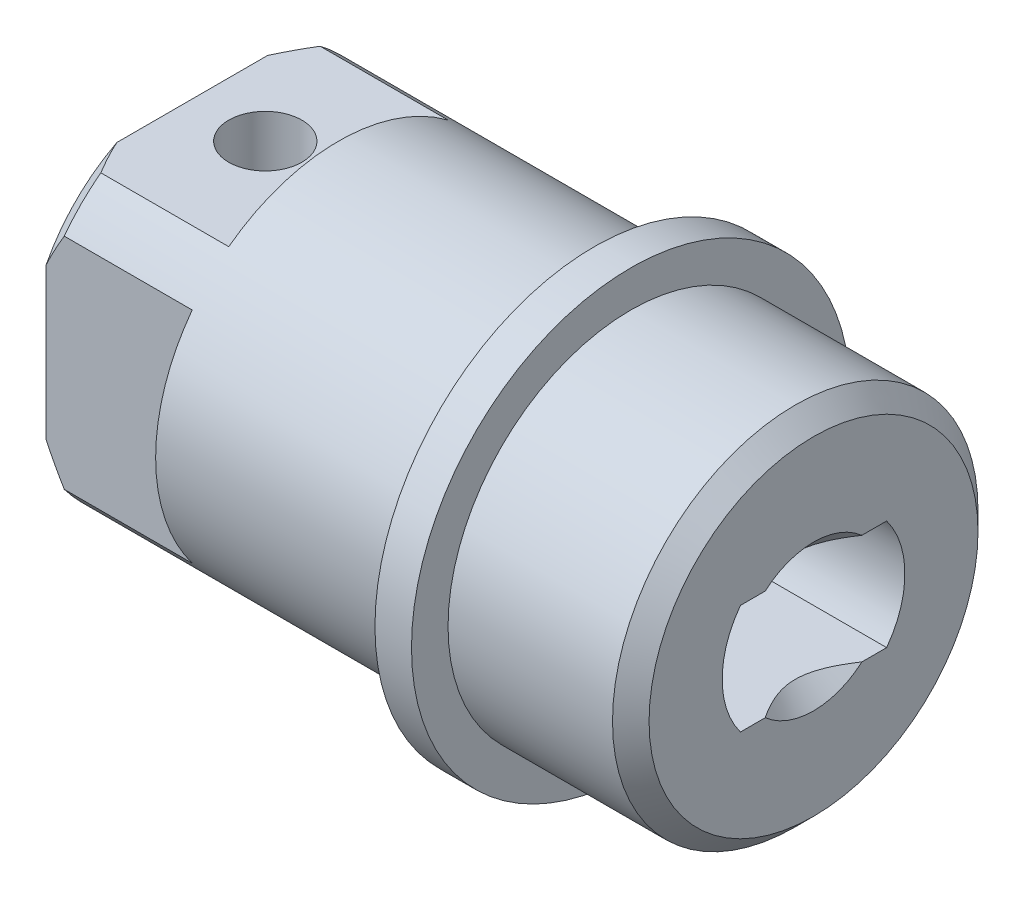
ISO-10303-21;
HEADER;
FILE_DESCRIPTION(('STEP AP214'),'2;1');
FILE_NAME('part.step','',(''),(''),'','','');
FILE_SCHEMA(('AUTOMOTIVE_DESIGN { 1 0 10303 214 1 1 1 1 }'));
ENDSEC;
DATA;
#1=APPLICATION_CONTEXT('core data for automotive mechanical design processes');
#2=APPLICATION_PROTOCOL_DEFINITION('international standard','automotive_design',2000,#1);
#3=PRODUCT_CONTEXT('',#1,'mechanical');
#4=PRODUCT('Part','Part','',(#3));
#5=PRODUCT_RELATED_PRODUCT_CATEGORY('part','',(#4));
#6=PRODUCT_DEFINITION_FORMATION('','',#4);
#7=PRODUCT_DEFINITION_CONTEXT('part definition',#1,'design');
#8=PRODUCT_DEFINITION('design','',#6,#7);
#9=PRODUCT_DEFINITION_SHAPE('','',#8);
#10=(LENGTH_UNIT() NAMED_UNIT(*) SI_UNIT(.MILLI.,.METRE.));
#11=(NAMED_UNIT(*) PLANE_ANGLE_UNIT() SI_UNIT($,.RADIAN.));
#12=(NAMED_UNIT(*) SI_UNIT($,.STERADIAN.) SOLID_ANGLE_UNIT());
#13=UNCERTAINTY_MEASURE_WITH_UNIT(LENGTH_MEASURE(1.E-05),#10,'distance_accuracy_value','');
#14=(GEOMETRIC_REPRESENTATION_CONTEXT(3) GLOBAL_UNCERTAINTY_ASSIGNED_CONTEXT((#13)) GLOBAL_UNIT_ASSIGNED_CONTEXT((#10,
#11,#12)) REPRESENTATION_CONTEXT('',''));
#15=CARTESIAN_POINT('',(0.,0.,0.));
#16=DIRECTION('',(0.,0.,1.));
#17=DIRECTION('',(1.,0.,0.));
#18=AXIS2_PLACEMENT_3D('',#15,#16,#17);
#19=CARTESIAN_POINT('',(17.,0.,0.));
#20=DIRECTION('',(1.,0.,0.));
#21=DIRECTION('',(0.,0.,-1.));
#22=AXIS2_PLACEMENT_3D('',#19,#20,#21);
#23=CONICAL_SURFACE('',#22,2.,0.785398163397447);
#24=CARTESIAN_POINT('',(18.2772597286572,1.5,-2.91383447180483));
#25=CARTESIAN_POINT('',(18.217244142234,1.5,-2.84632281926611));
#26=CARTESIAN_POINT('',(18.1574614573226,1.5,-2.77860211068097));
#27=CARTESIAN_POINT('',(18.0384866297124,1.5,-2.64263139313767));
#28=CARTESIAN_POINT('',(17.9792945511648,1.5,-2.57438132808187));
#29=CARTESIAN_POINT('',(17.8613803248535,1.5,-2.43695412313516));
#30=CARTESIAN_POINT('',(17.8026613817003,1.5,-2.36777422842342));
#31=CARTESIAN_POINT('',(17.6861500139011,1.5,-2.22864291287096));
#32=CARTESIAN_POINT('',(17.628357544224,1.5,-2.15869152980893));
#33=CARTESIAN_POINT('',(17.5105935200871,1.5,-2.01369677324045));
#34=CARTESIAN_POINT('',(17.4506930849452,1.5,-1.93859546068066));
#35=CARTESIAN_POINT('',(17.3326420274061,1.5,-1.78703130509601));
#36=CARTESIAN_POINT('',(17.2744912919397,1.5,-1.71056855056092));
#37=CARTESIAN_POINT('',(17.160664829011,1.5,-1.55602138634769));
#38=CARTESIAN_POINT('',(17.1049849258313,1.5,-1.47794006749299));
#39=CARTESIAN_POINT('',(16.9969436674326,1.5,-1.31952631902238));
#40=CARTESIAN_POINT('',(16.9445811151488,1.5,-1.2391947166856));
#41=CARTESIAN_POINT('',(16.8598759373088,1.5,-1.10052560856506));
#42=CARTESIAN_POINT('',(16.826296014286,1.5,-1.0429476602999));
#43=CARTESIAN_POINT('',(16.7621699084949,1.5,-0.926084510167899));
#44=CARTESIAN_POINT('',(16.7316246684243,1.5,-0.8667987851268));
#45=CARTESIAN_POINT('',(16.6747957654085,1.5,-0.746799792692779));
#46=CARTESIAN_POINT('',(16.6484787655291,1.5,-0.686102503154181));
#47=CARTESIAN_POINT('',(16.6010598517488,1.5,-0.562697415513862));
#48=CARTESIAN_POINT('',(16.5799546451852,1.5,-0.499990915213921));
#49=CARTESIAN_POINT('',(16.5499980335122,1.5,-0.392743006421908));
#50=CARTESIAN_POINT('',(16.539380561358,1.5,-0.348695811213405));
#51=CARTESIAN_POINT('',(16.5217274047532,1.5,-0.259894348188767));
#52=CARTESIAN_POINT('',(16.5146903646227,1.5,-0.215140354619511));
#53=CARTESIAN_POINT('',(16.5045647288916,1.5,-0.125302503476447));
#54=CARTESIAN_POINT('',(16.5014656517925,1.5,-0.0802198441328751));
#55=CARTESIAN_POINT('',(16.4993550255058,1.5,0.0100433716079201));
#56=CARTESIAN_POINT('',(16.5003435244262,1.5,0.0552239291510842));
#57=CARTESIAN_POINT('',(16.5063457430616,1.5,0.14522645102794));
#58=CARTESIAN_POINT('',(16.5113518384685,1.5,0.190048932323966));
#59=CARTESIAN_POINT('',(16.5251125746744,1.5,0.279116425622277));
#60=CARTESIAN_POINT('',(16.5338680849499,1.5,0.32336130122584));
#61=CARTESIAN_POINT('',(16.5547555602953,1.5,0.41121072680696));
#62=CARTESIAN_POINT('',(16.5668999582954,1.5,0.454812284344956));
#63=CARTESIAN_POINT('',(16.5940844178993,1.5,0.541090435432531));
#64=CARTESIAN_POINT('',(16.6091244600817,1.5,0.583767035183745));
#65=CARTESIAN_POINT('',(16.6679542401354,1.5,0.73656486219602));
#66=CARTESIAN_POINT('',(16.7188477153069,1.5,0.843947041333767));
#67=CARTESIAN_POINT('',(16.8307538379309,1.5,1.05333291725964));
#68=CARTESIAN_POINT('',(16.8917907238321,1.5,1.15532294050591));
#69=CARTESIAN_POINT('',(17.0210353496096,1.5,1.35668988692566));
#70=CARTESIAN_POINT('',(17.0893335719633,1.5,1.4560081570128));
#71=CARTESIAN_POINT('',(17.1948474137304,1.5,1.60265082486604));
#72=CARTESIAN_POINT('',(17.2305089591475,1.5,1.65111611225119));
#73=CARTESIAN_POINT('',(17.3026925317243,1.5,1.74740058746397));
#74=CARTESIAN_POINT('',(17.3392145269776,1.5,1.79521979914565));
#75=CARTESIAN_POINT('',(17.464041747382,1.5,1.95618427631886));
#76=CARTESIAN_POINT('',(17.5539909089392,1.5,2.06805306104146));
#77=CARTESIAN_POINT('',(17.7365139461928,1.5,2.28963458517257));
#78=CARTESIAN_POINT('',(17.8290881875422,1.5,2.39934702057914));
#79=CARTESIAN_POINT('',(18.016098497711,1.5,2.61724618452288));
#80=CARTESIAN_POINT('',(18.1105352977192,1.5,2.72543228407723));
#81=CARTESIAN_POINT('',(18.3007315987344,1.5,2.94063718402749));
#82=CARTESIAN_POINT('',(18.3964911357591,1.5,3.0476559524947));
#83=CARTESIAN_POINT('',(18.6856049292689,1.5,3.36781602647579));
#84=CARTESIAN_POINT('',(18.8804227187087,1.5,3.57963413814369));
#85=CARTESIAN_POINT('',(19.2723100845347,1.5,4.00106848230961));
#86=CARTESIAN_POINT('',(19.4693791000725,1.5,4.21068523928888));
#87=CARTESIAN_POINT('',(19.841677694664,1.5,4.60383939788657));
#88=CARTESIAN_POINT('',(20.0167401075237,1.5,4.78753524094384));
#89=CARTESIAN_POINT('',(20.367714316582,1.5,5.15413935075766));
#90=CARTESIAN_POINT('',(20.5436261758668,1.5,5.33704755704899));
#91=CARTESIAN_POINT('',(20.8954711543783,1.5,5.70165470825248));
#92=CARTESIAN_POINT('',(21.0714022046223,1.5,5.88335565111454));
#93=CARTESIAN_POINT('',(21.4237222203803,1.5,6.24628302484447));
#94=CARTESIAN_POINT('',(21.6001111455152,1.5,6.42750949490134));
#95=CARTESIAN_POINT('',(21.7766675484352,1.5,6.60857193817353));
#96=B_SPLINE_CURVE_WITH_KNOTS('',3,(#24,#25,#26,#27,#28,#29,#30,#31,#32,#33,#34,#35,#36,#37,#38,
#39,#40,#41,#42,#43,#44,#45,#46,#47,#48,#49,#50,#51,#52,#53,#54,#55,#56,#57,#58,#59,#60,#61,#62,
#63,#64,#65,#66,#67,#68,#69,#70,#71,#72,#73,#74,#75,#76,#77,#78,#79,#80,#81,#82,#83,#84,#85,#86,
#87,#88,#89,#90,#91,#92,#93,#94,#95),.UNSPECIFIED.,.F.,.F.,(4,2,2,2,2,2,2,2,2,2,2,2,2,2,2,2,2,2,
2,2,2,2,2,2,2,2,2,2,2,2,2,2,2,2,2,4),(0.,0.270994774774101,0.542018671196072,0.814232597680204,
1.08643325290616,1.3746059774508,1.66276003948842,1.95040697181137,2.23794950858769,
2.43784579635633,2.63780398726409,2.83609879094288,3.03426799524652,3.17006813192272,
3.30581681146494,3.44120341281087,3.57659160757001,3.71172347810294,3.84688670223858,
3.98255247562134,4.11821733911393,4.47365712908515,4.82995881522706,5.19138326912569,
5.37189350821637,5.55239706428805,5.98296540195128,6.41359401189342,6.84439517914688,
7.27520810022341,8.13853180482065,9.00164492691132,9.76290262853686,10.5242177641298,
11.2829675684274,12.0416525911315),.UNSPECIFIED.);
#97=CARTESIAN_POINT('',(17.,1.5,-1.3228756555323));
#98=VERTEX_POINT('',#97);
#99=CARTESIAN_POINT('',(17.,1.5,1.3228756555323));
#100=VERTEX_POINT('',#99);
#101=EDGE_CURVE('E12',#98,#100,#96,.T.);
#102=ORIENTED_EDGE('',*,*,#101,.F.);
#103=CARTESIAN_POINT('',(17.,0.,0.));
#104=DIRECTION('',(-1.,0.,0.));
#105=DIRECTION('',(0.,0.,1.));
#106=AXIS2_PLACEMENT_3D('',#103,#104,#105);
#107=CIRCLE('',#106,2.);
#108=EDGE_CURVE('E288',#100,#98,#107,.T.);
#109=ORIENTED_EDGE('',*,*,#108,.F.);
#110=EDGE_LOOP('',(#102,#109));
#111=FACE_BOUND('',#110,.T.);
#112=ADVANCED_FACE('F38',(#111),#23,.F.);
#113=CARTESIAN_POINT('',(0.,0.,0.));
#114=DIRECTION('',(1.,0.,0.));
#115=DIRECTION('',(0.,0.,-1.));
#116=AXIS2_PLACEMENT_3D('',#113,#114,#115);
#117=PLANE('',#116);
#118=DIRECTION('',(0.,1.,0.));
#119=VECTOR('',#118,1.);
#120=CARTESIAN_POINT('',(0.,-4.,4.));
#121=LINE('',#120,#119);
#122=CARTESIAN_POINT('',(0.,-2.06155281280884,4.));
#123=VERTEX_POINT('',#122);
#124=CARTESIAN_POINT('',(0.,2.06155281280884,4.));
#125=VERTEX_POINT('',#124);
#126=EDGE_CURVE('E231',#123,#125,#121,.T.);
#127=ORIENTED_EDGE('',*,*,#126,.T.);
#128=CARTESIAN_POINT('',(0.,0.,0.));
#129=DIRECTION('',(1.,0.,0.));
#130=DIRECTION('',(0.,0.,-1.));
#131=AXIS2_PLACEMENT_3D('',#128,#129,#130);
#132=CIRCLE('',#131,4.5);
#133=CARTESIAN_POINT('',(0.,4.,2.06155281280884));
#134=VERTEX_POINT('',#133);
#135=EDGE_CURVE('E462',#125,#134,#132,.F.);
#136=ORIENTED_EDGE('',*,*,#135,.T.);
#137=DIRECTION('',(0.,0.,-1.));
#138=VECTOR('',#137,1.);
#139=CARTESIAN_POINT('',(0.,4.,-4.));
#140=LINE('',#139,#138);
#141=CARTESIAN_POINT('',(0.,4.,-2.06155281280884));
#142=VERTEX_POINT('',#141);
#143=EDGE_CURVE('E247',#134,#142,#140,.T.);
#144=ORIENTED_EDGE('',*,*,#143,.T.);
#145=CARTESIAN_POINT('',(0.,2.06155281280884,-4.));
#146=VERTEX_POINT('',#145);
#147=EDGE_CURVE('E294',#142,#146,#132,.F.);
#148=ORIENTED_EDGE('',*,*,#147,.T.);
#149=DIRECTION('',(0.,-1.,0.));
#150=VECTOR('',#149,1.);
#151=CARTESIAN_POINT('',(0.,-4.,-4.));
#152=LINE('',#151,#150);
#153=CARTESIAN_POINT('',(0.,-2.06155281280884,-4.));
#154=VERTEX_POINT('',#153);
#155=EDGE_CURVE('E250',#146,#154,#152,.T.);
#156=ORIENTED_EDGE('',*,*,#155,.T.);
#157=CARTESIAN_POINT('',(0.,-4.,-2.06155281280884));
#158=VERTEX_POINT('',#157);
#159=EDGE_CURVE('E295',#154,#158,#132,.F.);
#160=ORIENTED_EDGE('',*,*,#159,.T.);
#161=DIRECTION('',(0.,0.,1.));
#162=VECTOR('',#161,1.);
#163=CARTESIAN_POINT('',(0.,-4.,-4.));
#164=LINE('',#163,#162);
#165=CARTESIAN_POINT('',(0.,-4.,2.06155281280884));
#166=VERTEX_POINT('',#165);
#167=EDGE_CURVE('E236',#158,#166,#164,.T.);
#168=ORIENTED_EDGE('',*,*,#167,.T.);
#169=EDGE_CURVE('E299',#166,#123,#132,.F.);
#170=ORIENTED_EDGE('',*,*,#169,.T.);
#171=EDGE_LOOP('',(#127,#136,#144,#148,#156,#160,#168,#170));
#172=FACE_BOUND('',#171,.T.);
#173=ADVANCED_FACE('F367',(#172),#117,.F.);
#174=CARTESIAN_POINT('',(0.,0.,0.));
#175=DIRECTION('',(-1.,0.,0.));
#176=DIRECTION('',(0.,0.,1.));
#177=AXIS2_PLACEMENT_3D('',#174,#175,#176);
#178=CYLINDRICAL_SURFACE('',#177,5.);
#179=CARTESIAN_POINT('',(11.,0.,0.));
#180=DIRECTION('',(-1.,0.,0.));
#181=DIRECTION('',(0.,0.,1.));
#182=AXIS2_PLACEMENT_3D('',#179,#180,#181);
#183=CIRCLE('',#182,5.);
#184=CARTESIAN_POINT('',(11.,0.,5.));
#185=VERTEX_POINT('',#184);
#186=EDGE_CURVE('E281',#185,#185,#183,.T.);
#187=ORIENTED_EDGE('',*,*,#186,.T.);
#188=EDGE_LOOP('',(#187));
#189=FACE_BOUND('',#188,.T.);
#190=DIRECTION('',(-1.,0.,0.));
#191=VECTOR('',#190,1.);
#192=CARTESIAN_POINT('',(0.,3.,4.));
#193=LINE('',#192,#191);
#194=CARTESIAN_POINT('',(4.,3.,4.));
#195=VERTEX_POINT('',#194);
#196=CARTESIAN_POINT('',(0.499999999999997,3.,4.));
#197=VERTEX_POINT('',#196);
#198=EDGE_CURVE('E265',#195,#197,#193,.T.);
#199=ORIENTED_EDGE('',*,*,#198,.F.);
#200=CARTESIAN_POINT('',(4.,0.,0.));
#201=DIRECTION('',(-1.,0.,0.));
#202=DIRECTION('',(0.,0.,1.));
#203=AXIS2_PLACEMENT_3D('',#200,#201,#202);
#204=CIRCLE('',#203,5.);
#205=CARTESIAN_POINT('',(4.,-3.,4.));
#206=VERTEX_POINT('',#205);
#207=EDGE_CURVE('E352',#206,#195,#204,.T.);
#208=ORIENTED_EDGE('',*,*,#207,.F.);
#209=DIRECTION('',(-1.,0.,0.));
#210=VECTOR('',#209,1.);
#211=CARTESIAN_POINT('',(0.,-3.,4.));
#212=LINE('',#211,#210);
#213=CARTESIAN_POINT('',(0.500000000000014,-3.00000000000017,4.));
#214=VERTEX_POINT('',#213);
#215=EDGE_CURVE('E267',#214,#206,#212,.F.);
#216=ORIENTED_EDGE('',*,*,#215,.F.);
#217=CARTESIAN_POINT('',(0.499999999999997,0.,0.));
#218=DIRECTION('',(1.,0.,0.));
#219=DIRECTION('',(0.,0.,-1.));
#220=AXIS2_PLACEMENT_3D('',#217,#218,#219);
#221=CIRCLE('',#220,5.);
#222=CARTESIAN_POINT('',(0.499999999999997,-4.,3.));
#223=VERTEX_POINT('',#222);
#224=EDGE_CURVE('E449',#214,#223,#221,.T.);
#225=ORIENTED_EDGE('',*,*,#224,.T.);
#226=DIRECTION('',(-1.,0.,0.));
#227=VECTOR('',#226,1.);
#228=CARTESIAN_POINT('',(0.,-4.,3.));
#229=LINE('',#228,#227);
#230=CARTESIAN_POINT('',(4.,-4.,3.));
#231=VERTEX_POINT('',#230);
#232=EDGE_CURVE('E261',#231,#223,#229,.T.);
#233=ORIENTED_EDGE('',*,*,#232,.F.);
#234=CARTESIAN_POINT('',(4.,-4.,-3.));
#235=VERTEX_POINT('',#234);
#236=EDGE_CURVE('E442',#235,#231,#204,.T.);
#237=ORIENTED_EDGE('',*,*,#236,.F.);
#238=DIRECTION('',(-1.,0.,0.));
#239=VECTOR('',#238,1.);
#240=CARTESIAN_POINT('',(0.,-4.,-3.));
#241=LINE('',#240,#239);
#242=CARTESIAN_POINT('',(0.500000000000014,-4.,-3.00000000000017));
#243=VERTEX_POINT('',#242);
#244=EDGE_CURVE('E263',#243,#235,#241,.F.);
#245=ORIENTED_EDGE('',*,*,#244,.F.);
#246=CARTESIAN_POINT('',(0.499999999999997,-3.,-4.));
#247=VERTEX_POINT('',#246);
#248=EDGE_CURVE('E298',#243,#247,#221,.T.);
#249=ORIENTED_EDGE('',*,*,#248,.T.);
#250=DIRECTION('',(-1.,0.,0.));
#251=VECTOR('',#250,1.);
#252=CARTESIAN_POINT('',(0.,-3.,-4.));
#253=LINE('',#252,#251);
#254=CARTESIAN_POINT('',(4.,-3.,-4.));
#255=VERTEX_POINT('',#254);
#256=EDGE_CURVE('E67',#255,#247,#253,.T.);
#257=ORIENTED_EDGE('',*,*,#256,.F.);
#258=CARTESIAN_POINT('',(4.,3.,-4.));
#259=VERTEX_POINT('',#258);
#260=EDGE_CURVE('E351',#259,#255,#204,.T.);
#261=ORIENTED_EDGE('',*,*,#260,.F.);
#262=DIRECTION('',(-1.,0.,0.));
#263=VECTOR('',#262,1.);
#264=CARTESIAN_POINT('',(0.,3.,-4.));
#265=LINE('',#264,#263);
#266=CARTESIAN_POINT('',(0.500000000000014,3.00000000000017,-4.));
#267=VERTEX_POINT('',#266);
#268=EDGE_CURVE('E259',#267,#259,#265,.F.);
#269=ORIENTED_EDGE('',*,*,#268,.F.);
#270=CARTESIAN_POINT('',(0.499999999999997,4.,-3.));
#271=VERTEX_POINT('',#270);
#272=EDGE_CURVE('E300',#267,#271,#221,.T.);
#273=ORIENTED_EDGE('',*,*,#272,.T.);
#274=DIRECTION('',(-1.,0.,0.));
#275=VECTOR('',#274,1.);
#276=CARTESIAN_POINT('',(0.,4.,-3.));
#277=LINE('',#276,#275);
#278=CARTESIAN_POINT('',(4.,4.,-3.));
#279=VERTEX_POINT('',#278);
#280=EDGE_CURVE('E244',#279,#271,#277,.T.);
#281=ORIENTED_EDGE('',*,*,#280,.F.);
#282=CARTESIAN_POINT('',(4.,4.,3.));
#283=VERTEX_POINT('',#282);
#284=EDGE_CURVE('E349',#283,#279,#204,.T.);
#285=ORIENTED_EDGE('',*,*,#284,.F.);
#286=DIRECTION('',(-1.,0.,0.));
#287=VECTOR('',#286,1.);
#288=CARTESIAN_POINT('',(0.,4.,3.));
#289=LINE('',#288,#287);
#290=CARTESIAN_POINT('',(0.500000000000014,4.,3.00000000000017));
#291=VERTEX_POINT('',#290);
#292=EDGE_CURVE('E256',#291,#283,#289,.F.);
#293=ORIENTED_EDGE('',*,*,#292,.F.);
#294=EDGE_CURVE('E304',#291,#197,#221,.T.);
#295=ORIENTED_EDGE('',*,*,#294,.T.);
#296=EDGE_LOOP('',(#199,#208,#216,#225,#233,#237,#245,#249,#257,#261,#269,#273,#281,#285,#293,#295));
#297=FACE_BOUND('',#296,.T.);
#298=ADVANCED_FACE('F381',(#189,#297),#178,.T.);
#299=CARTESIAN_POINT('',(0.,0.,0.));
#300=DIRECTION('',(1.,0.,0.));
#301=DIRECTION('',(0.,0.,-1.));
#302=AXIS2_PLACEMENT_3D('',#299,#300,#301);
#303=CONICAL_SURFACE('',#302,4.5,0.785398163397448);
#304=ORIENTED_EDGE('',*,*,#224,.F.);
#305=CARTESIAN_POINT('',(5.17514602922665,-8.80956586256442,4.));
#306=CARTESIAN_POINT('',(5.05766249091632,-8.68053657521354,4.));
#307=CARTESIAN_POINT('',(4.94041750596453,-8.55129017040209,4.));
#308=CARTESIAN_POINT('',(4.70647437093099,-8.29230139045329,4.));
#309=CARTESIAN_POINT('',(4.58977622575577,-8.1625590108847,4.));
#310=CARTESIAN_POINT('',(4.24055046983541,-7.77243250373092,4.));
#311=CARTESIAN_POINT('',(4.00895149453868,-7.51121471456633,4.));
#312=CARTESIAN_POINT('',(3.54725301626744,-6.98388476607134,4.));
#313=CARTESIAN_POINT('',(3.31717883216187,-6.7177504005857,4.));
#314=CARTESIAN_POINT('',(2.86158188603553,-6.1816595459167,4.));
#315=CARTESIAN_POINT('',(2.63605849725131,-5.91170359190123,4.));
#316=CARTESIAN_POINT('',(2.22272590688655,-5.40493941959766,4.));
#317=CARTESIAN_POINT('',(2.03407810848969,-5.16881684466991,4.));
#318=CARTESIAN_POINT('',(1.66328195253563,-4.69135316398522,4.));
#319=CARTESIAN_POINT('',(1.48113567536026,-4.4500104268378,4.));
#320=CARTESIAN_POINT('',(1.2152182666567,-4.08298272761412,4.));
#321=CARTESIAN_POINT('',(1.12785884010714,-3.95989862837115,4.));
#322=CARTESIAN_POINT('',(0.956071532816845,-3.71170566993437,4.));
#323=CARTESIAN_POINT('',(0.871643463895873,-3.58659694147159,4.));
#324=CARTESIAN_POINT('',(0.706433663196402,-3.33407612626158,4.));
#325=CARTESIAN_POINT('',(0.625650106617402,-3.20666523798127,4.));
#326=CARTESIAN_POINT('',(0.468584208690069,-2.94910980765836,4.));
#327=CARTESIAN_POINT('',(0.392301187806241,-2.81896568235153,4.));
#328=CARTESIAN_POINT('',(0.247849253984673,-2.55992956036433,4.));
#329=CARTESIAN_POINT('',(0.179493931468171,-2.43114215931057,4.));
#330=CARTESIAN_POINT('',(0.0494038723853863,-2.17022227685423,4.));
#331=CARTESIAN_POINT('',(-0.0123302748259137,-2.03808949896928,4.));
#332=CARTESIAN_POINT('',(-0.127371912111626,-1.770437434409,4.));
#333=CARTESIAN_POINT('',(-0.180693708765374,-1.63492436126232,4.));
#334=CARTESIAN_POINT('',(-0.276995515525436,-1.36025065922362,4.));
#335=CARTESIAN_POINT('',(-0.319978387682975,-1.22109105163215,4.));
#336=CARTESIAN_POINT('',(-0.386632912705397,-0.96544179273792,4.));
#337=CARTESIAN_POINT('',(-0.41240387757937,-0.849502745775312,4.));
#338=CARTESIAN_POINT('',(-0.454488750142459,-0.615910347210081,4.));
#339=CARTESIAN_POINT('',(-0.470804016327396,-0.498257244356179,4.));
#340=CARTESIAN_POINT('',(-0.493134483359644,-0.2621929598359,4.));
#341=CARTESIAN_POINT('',(-0.499169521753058,-0.143783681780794,4.));
#342=CARTESIAN_POINT('',(-0.500669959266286,0.093104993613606,4.));
#343=CARTESIAN_POINT('',(-0.496135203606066,0.211584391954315,4.));
#344=CARTESIAN_POINT('',(-0.476772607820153,0.447361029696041,4.));
#345=CARTESIAN_POINT('',(-0.461972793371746,0.564660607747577,4.));
#346=CARTESIAN_POINT('',(-0.422859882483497,0.797668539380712,4.));
#347=CARTESIAN_POINT('',(-0.398544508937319,0.91337650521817,4.));
#348=CARTESIAN_POINT('',(-0.341399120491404,1.14296280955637,4.));
#349=CARTESIAN_POINT('',(-0.308547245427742,1.2568356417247,4.));
#350=CARTESIAN_POINT('',(-0.235553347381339,1.48218513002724,4.));
#351=CARTESIAN_POINT('',(-0.195411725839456,1.59366191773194,4.));
#352=CARTESIAN_POINT('',(-0.092822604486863,1.85544100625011,4.));
#353=CARTESIAN_POINT('',(-0.0276476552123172,2.00467054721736,4.));
#354=CARTESIAN_POINT('',(0.111730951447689,2.2988825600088,4.));
#355=CARTESIAN_POINT('',(0.185939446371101,2.44386270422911,4.));
#356=CARTESIAN_POINT('',(0.341497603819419,2.73030938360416,4.));
#357=CARTESIAN_POINT('',(0.422862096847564,2.87176780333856,4.));
#358=CARTESIAN_POINT('',(0.591029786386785,3.15135685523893,4.));
#359=CARTESIAN_POINT('',(0.677832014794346,3.28948807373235,4.));
#360=CARTESIAN_POINT('',(0.856670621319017,3.56439746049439,4.));
#361=CARTESIAN_POINT('',(0.94875276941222,3.70114571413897,4.));
#362=CARTESIAN_POINT('',(1.13640185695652,3.97222727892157,4.));
#363=CARTESIAN_POINT('',(1.23196891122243,4.10656051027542,4.));
#364=CARTESIAN_POINT('',(1.425787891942,4.37302047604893,4.));
#365=CARTESIAN_POINT('',(1.52403641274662,4.50514969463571,4.));
#366=CARTESIAN_POINT('',(1.72281606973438,4.76768135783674,4.));
#367=CARTESIAN_POINT('',(1.82334726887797,4.89808375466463,4.));
#368=CARTESIAN_POINT('',(2.05487453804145,5.19394883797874,4.));
#369=CARTESIAN_POINT('',(2.18647412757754,5.35893877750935,4.));
#370=CARTESIAN_POINT('',(2.45212198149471,5.68693392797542,4.));
#371=CARTESIAN_POINT('',(2.58617028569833,5.84993910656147,4.));
#372=CARTESIAN_POINT('',(2.99136930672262,6.33664933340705,4.));
#373=CARTESIAN_POINT('',(3.26546027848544,6.65790539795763,4.));
#374=CARTESIAN_POINT('',(3.81038791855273,7.28601548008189,4.));
#375=CARTESIAN_POINT('',(4.08106531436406,7.59300852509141,4.));
#376=CARTESIAN_POINT('',(4.48965202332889,8.05099780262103,4.));
#377=CARTESIAN_POINT('',(4.62622535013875,8.20318869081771,4.));
#378=CARTESIAN_POINT('',(4.9001393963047,8.50687386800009,4.));
#379=CARTESIAN_POINT('',(5.03748010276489,8.6583681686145,4.));
#380=CARTESIAN_POINT('',(5.17514602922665,8.80956586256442,4.));
#381=B_SPLINE_CURVE_WITH_KNOTS('',3,(#305,#306,#307,#308,#309,#310,#311,#312,#313,#314,#315,
#316,#317,#318,#319,#320,#321,#322,#323,#324,#325,#326,#327,#328,#329,#330,#331,#332,#333,#334,
#335,#336,#337,#338,#339,#340,#341,#342,#343,#344,#345,#346,#347,#348,#349,#350,#351,#352,#353,
#354,#355,#356,#357,#358,#359,#360,#361,#362,#363,#364,#365,#366,#367,#368,#369,#370,#371,#372,
#373,#374,#375,#376,#377,#378,#379,#380),.UNSPECIFIED.,.F.,.F.,(4,2,2,2,2,2,2,2,2,2,2,2,2,2,2,2,
2,2,2,2,2,2,2,2,2,2,2,2,2,2,2,2,2,2,2,2,2,4),(0.,0.523505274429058,1.04701523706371,
2.09430200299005,3.14966143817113,4.20487451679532,5.11148738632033,6.01838780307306,
6.47116023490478,6.92390354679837,7.37641759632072,7.82886314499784,8.26612225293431,
8.70342024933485,9.13996634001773,9.57639144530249,9.93235423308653,10.2882658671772,
10.6434899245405,10.998719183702,11.3529823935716,11.7073304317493,12.0625949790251,
12.4178399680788,12.9059511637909,13.3943249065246,13.8837357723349,14.3730597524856,
14.8675764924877,15.3621095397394,15.8560413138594,16.3499867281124,16.9830915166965,
17.6162066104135,18.8829865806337,20.110797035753,20.7242513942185,21.3376954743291),.UNSPECIFIED.);
#382=EDGE_CURVE('E343',#214,#123,#381,.T.);
#383=ORIENTED_EDGE('',*,*,#382,.T.);
#384=ORIENTED_EDGE('',*,*,#169,.F.);
#385=CARTESIAN_POINT('',(5.17514602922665,-4.,-8.80956586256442));
#386=CARTESIAN_POINT('',(5.05766249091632,-4.,-8.68053657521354));
#387=CARTESIAN_POINT('',(4.94041750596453,-4.,-8.55129017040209));
#388=CARTESIAN_POINT('',(4.70647437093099,-4.,-8.29230139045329));
#389=CARTESIAN_POINT('',(4.58977622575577,-4.,-8.1625590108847));
#390=CARTESIAN_POINT('',(4.24055046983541,-4.,-7.77243250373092));
#391=CARTESIAN_POINT('',(4.00895149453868,-4.,-7.51121471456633));
#392=CARTESIAN_POINT('',(3.54725301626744,-4.,-6.98388476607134));
#393=CARTESIAN_POINT('',(3.31717883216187,-4.,-6.7177504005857));
#394=CARTESIAN_POINT('',(2.86158188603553,-4.,-6.1816595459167));
#395=CARTESIAN_POINT('',(2.63605849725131,-4.,-5.91170359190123));
#396=CARTESIAN_POINT('',(2.22272590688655,-4.,-5.40493941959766));
#397=CARTESIAN_POINT('',(2.03407810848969,-4.,-5.16881684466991));
#398=CARTESIAN_POINT('',(1.66328195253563,-4.,-4.69135316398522));
#399=CARTESIAN_POINT('',(1.48113567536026,-4.,-4.4500104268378));
#400=CARTESIAN_POINT('',(1.2152182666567,-4.,-4.08298272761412));
#401=CARTESIAN_POINT('',(1.12785884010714,-4.,-3.95989862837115));
#402=CARTESIAN_POINT('',(0.956071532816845,-4.,-3.71170566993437));
#403=CARTESIAN_POINT('',(0.871643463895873,-4.,-3.58659694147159));
#404=CARTESIAN_POINT('',(0.706433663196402,-4.,-3.33407612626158));
#405=CARTESIAN_POINT('',(0.625650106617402,-4.,-3.20666523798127));
#406=CARTESIAN_POINT('',(0.468584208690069,-4.,-2.94910980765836));
#407=CARTESIAN_POINT('',(0.392301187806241,-4.,-2.81896568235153));
#408=CARTESIAN_POINT('',(0.247849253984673,-4.,-2.55992956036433));
#409=CARTESIAN_POINT('',(0.179493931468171,-4.,-2.43114215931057));
#410=CARTESIAN_POINT('',(0.0494038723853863,-4.,-2.17022227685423));
#411=CARTESIAN_POINT('',(-0.0123302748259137,-4.,-2.03808949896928));
#412=CARTESIAN_POINT('',(-0.127371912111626,-4.,-1.770437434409));
#413=CARTESIAN_POINT('',(-0.180693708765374,-4.,-1.63492436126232));
#414=CARTESIAN_POINT('',(-0.276995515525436,-4.,-1.36025065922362));
#415=CARTESIAN_POINT('',(-0.319978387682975,-4.,-1.22109105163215));
#416=CARTESIAN_POINT('',(-0.386632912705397,-4.,-0.96544179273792));
#417=CARTESIAN_POINT('',(-0.41240387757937,-4.,-0.849502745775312));
#418=CARTESIAN_POINT('',(-0.454488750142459,-4.,-0.615910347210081));
#419=CARTESIAN_POINT('',(-0.470804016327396,-4.,-0.498257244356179));
#420=CARTESIAN_POINT('',(-0.493134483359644,-4.,-0.2621929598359));
#421=CARTESIAN_POINT('',(-0.499169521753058,-4.,-0.143783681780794));
#422=CARTESIAN_POINT('',(-0.500669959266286,-4.,0.093104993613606));
#423=CARTESIAN_POINT('',(-0.496135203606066,-4.,0.211584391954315));
#424=CARTESIAN_POINT('',(-0.476772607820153,-4.,0.447361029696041));
#425=CARTESIAN_POINT('',(-0.461972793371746,-4.,0.564660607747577));
#426=CARTESIAN_POINT('',(-0.422859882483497,-4.,0.797668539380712));
#427=CARTESIAN_POINT('',(-0.398544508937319,-4.,0.91337650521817));
#428=CARTESIAN_POINT('',(-0.341399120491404,-4.,1.14296280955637));
#429=CARTESIAN_POINT('',(-0.308547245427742,-4.,1.2568356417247));
#430=CARTESIAN_POINT('',(-0.235553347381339,-4.,1.48218513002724));
#431=CARTESIAN_POINT('',(-0.195411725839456,-4.,1.59366191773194));
#432=CARTESIAN_POINT('',(-0.092822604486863,-4.,1.85544100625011));
#433=CARTESIAN_POINT('',(-0.0276476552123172,-4.,2.00467054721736));
#434=CARTESIAN_POINT('',(0.111730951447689,-4.,2.2988825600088));
#435=CARTESIAN_POINT('',(0.185939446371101,-4.,2.44386270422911));
#436=CARTESIAN_POINT('',(0.341497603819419,-4.,2.73030938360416));
#437=CARTESIAN_POINT('',(0.422862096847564,-4.,2.87176780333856));
#438=CARTESIAN_POINT('',(0.591029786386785,-4.,3.15135685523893));
#439=CARTESIAN_POINT('',(0.677832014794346,-4.,3.28948807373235));
#440=CARTESIAN_POINT('',(0.856670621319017,-4.,3.56439746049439));
#441=CARTESIAN_POINT('',(0.94875276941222,-4.,3.70114571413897));
#442=CARTESIAN_POINT('',(1.13640185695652,-4.,3.97222727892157));
#443=CARTESIAN_POINT('',(1.23196891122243,-4.,4.10656051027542));
#444=CARTESIAN_POINT('',(1.425787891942,-4.,4.37302047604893));
#445=CARTESIAN_POINT('',(1.52403641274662,-4.,4.50514969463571));
#446=CARTESIAN_POINT('',(1.72281606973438,-4.,4.76768135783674));
#447=CARTESIAN_POINT('',(1.82334726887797,-4.,4.89808375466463));
#448=CARTESIAN_POINT('',(2.05487453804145,-4.,5.19394883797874));
#449=CARTESIAN_POINT('',(2.18647412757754,-4.,5.35893877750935));
#450=CARTESIAN_POINT('',(2.45212198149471,-4.,5.68693392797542));
#451=CARTESIAN_POINT('',(2.58617028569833,-4.,5.84993910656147));
#452=CARTESIAN_POINT('',(2.99136930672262,-4.,6.33664933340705));
#453=CARTESIAN_POINT('',(3.26546027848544,-4.,6.65790539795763));
#454=CARTESIAN_POINT('',(3.81038791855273,-4.,7.28601548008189));
#455=CARTESIAN_POINT('',(4.08106531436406,-4.,7.59300852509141));
#456=CARTESIAN_POINT('',(4.48965202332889,-4.,8.05099780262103));
#457=CARTESIAN_POINT('',(4.62622535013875,-4.,8.20318869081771));
#458=CARTESIAN_POINT('',(4.9001393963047,-4.,8.50687386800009));
#459=CARTESIAN_POINT('',(5.03748010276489,-4.,8.6583681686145));
#460=CARTESIAN_POINT('',(5.17514602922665,-4.,8.80956586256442));
#461=B_SPLINE_CURVE_WITH_KNOTS('',3,(#385,#386,#387,#388,#389,#390,#391,#392,#393,#394,#395,
#396,#397,#398,#399,#400,#401,#402,#403,#404,#405,#406,#407,#408,#409,#410,#411,#412,#413,#414,
#415,#416,#417,#418,#419,#420,#421,#422,#423,#424,#425,#426,#427,#428,#429,#430,#431,#432,#433,
#434,#435,#436,#437,#438,#439,#440,#441,#442,#443,#444,#445,#446,#447,#448,#449,#450,#451,#452,
#453,#454,#455,#456,#457,#458,#459,#460),.UNSPECIFIED.,.F.,.F.,(4,2,2,2,2,2,2,2,2,2,2,2,2,2,2,2,
2,2,2,2,2,2,2,2,2,2,2,2,2,2,2,2,2,2,2,2,2,4),(0.,0.523505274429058,1.04701523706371,
2.09430200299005,3.14966143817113,4.20487451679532,5.11148738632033,6.01838780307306,
6.47116023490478,6.92390354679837,7.37641759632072,7.82886314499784,8.26612225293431,
8.70342024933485,9.13996634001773,9.57639144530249,9.93235423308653,10.2882658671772,
10.6434899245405,10.998719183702,11.3529823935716,11.7073304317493,12.0625949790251,
12.4178399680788,12.9059511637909,13.3943249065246,13.8837357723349,14.3730597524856,
14.8675764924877,15.3621095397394,15.8560413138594,16.3499867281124,16.9830915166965,
17.6162066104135,18.8829865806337,20.110797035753,20.7242513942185,21.3376954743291),.UNSPECIFIED.);
#462=EDGE_CURVE('E345',#166,#223,#461,.T.);
#463=ORIENTED_EDGE('',*,*,#462,.T.);
#464=EDGE_LOOP('',(#304,#383,#384,#463));
#465=FACE_BOUND('',#464,.T.);
#466=ADVANCED_FACE('F40',(#465),#303,.T.);
#467=ORIENTED_EDGE('',*,*,#135,.F.);
#468=EDGE_CURVE('E337',#125,#197,#381,.T.);
#469=ORIENTED_EDGE('',*,*,#468,.T.);
#470=ORIENTED_EDGE('',*,*,#294,.F.);
#471=CARTESIAN_POINT('',(5.17514602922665,4.,8.80956586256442));
#472=CARTESIAN_POINT('',(5.05766249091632,4.,8.68053657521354));
#473=CARTESIAN_POINT('',(4.94041750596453,4.,8.55129017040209));
#474=CARTESIAN_POINT('',(4.70647437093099,4.,8.29230139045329));
#475=CARTESIAN_POINT('',(4.58977622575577,4.,8.1625590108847));
#476=CARTESIAN_POINT('',(4.24055046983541,4.,7.77243250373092));
#477=CARTESIAN_POINT('',(4.00895149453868,4.,7.51121471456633));
#478=CARTESIAN_POINT('',(3.54725301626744,4.,6.98388476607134));
#479=CARTESIAN_POINT('',(3.31717883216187,4.,6.7177504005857));
#480=CARTESIAN_POINT('',(2.86158188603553,4.,6.1816595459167));
#481=CARTESIAN_POINT('',(2.63605849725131,4.,5.91170359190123));
#482=CARTESIAN_POINT('',(2.22272590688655,4.,5.40493941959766));
#483=CARTESIAN_POINT('',(2.03407810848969,4.,5.16881684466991));
#484=CARTESIAN_POINT('',(1.66328195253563,4.,4.69135316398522));
#485=CARTESIAN_POINT('',(1.48113567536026,4.,4.4500104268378));
#486=CARTESIAN_POINT('',(1.2152182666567,4.,4.08298272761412));
#487=CARTESIAN_POINT('',(1.12785884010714,4.,3.95989862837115));
#488=CARTESIAN_POINT('',(0.956071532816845,4.,3.71170566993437));
#489=CARTESIAN_POINT('',(0.871643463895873,4.,3.58659694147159));
#490=CARTESIAN_POINT('',(0.706433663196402,4.,3.33407612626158));
#491=CARTESIAN_POINT('',(0.625650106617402,4.,3.20666523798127));
#492=CARTESIAN_POINT('',(0.468584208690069,4.,2.94910980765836));
#493=CARTESIAN_POINT('',(0.392301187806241,4.,2.81896568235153));
#494=CARTESIAN_POINT('',(0.247849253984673,4.,2.55992956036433));
#495=CARTESIAN_POINT('',(0.179493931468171,4.,2.43114215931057));
#496=CARTESIAN_POINT('',(0.0494038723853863,4.,2.17022227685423));
#497=CARTESIAN_POINT('',(-0.0123302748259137,4.,2.03808949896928));
#498=CARTESIAN_POINT('',(-0.127371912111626,4.,1.770437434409));
#499=CARTESIAN_POINT('',(-0.180693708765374,4.,1.63492436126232));
#500=CARTESIAN_POINT('',(-0.276995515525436,4.,1.36025065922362));
#501=CARTESIAN_POINT('',(-0.319978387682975,4.,1.22109105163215));
#502=CARTESIAN_POINT('',(-0.386632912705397,4.,0.96544179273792));
#503=CARTESIAN_POINT('',(-0.41240387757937,4.,0.849502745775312));
#504=CARTESIAN_POINT('',(-0.454488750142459,4.,0.615910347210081));
#505=CARTESIAN_POINT('',(-0.470804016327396,4.,0.498257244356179));
#506=CARTESIAN_POINT('',(-0.493134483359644,4.,0.2621929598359));
#507=CARTESIAN_POINT('',(-0.499169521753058,4.,0.143783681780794));
#508=CARTESIAN_POINT('',(-0.500669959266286,4.,-0.093104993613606));
#509=CARTESIAN_POINT('',(-0.496135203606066,4.,-0.211584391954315));
#510=CARTESIAN_POINT('',(-0.476772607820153,4.,-0.447361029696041));
#511=CARTESIAN_POINT('',(-0.461972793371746,4.,-0.564660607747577));
#512=CARTESIAN_POINT('',(-0.422859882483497,4.,-0.797668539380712));
#513=CARTESIAN_POINT('',(-0.398544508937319,4.,-0.91337650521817));
#514=CARTESIAN_POINT('',(-0.341399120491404,4.,-1.14296280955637));
#515=CARTESIAN_POINT('',(-0.308547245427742,4.,-1.2568356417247));
#516=CARTESIAN_POINT('',(-0.235553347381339,4.,-1.48218513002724));
#517=CARTESIAN_POINT('',(-0.195411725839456,4.,-1.59366191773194));
#518=CARTESIAN_POINT('',(-0.092822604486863,4.,-1.85544100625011));
#519=CARTESIAN_POINT('',(-0.0276476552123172,4.,-2.00467054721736));
#520=CARTESIAN_POINT('',(0.111730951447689,4.,-2.2988825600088));
#521=CARTESIAN_POINT('',(0.185939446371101,4.,-2.44386270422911));
#522=CARTESIAN_POINT('',(0.341497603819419,4.,-2.73030938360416));
#523=CARTESIAN_POINT('',(0.422862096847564,4.,-2.87176780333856));
#524=CARTESIAN_POINT('',(0.591029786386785,4.,-3.15135685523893));
#525=CARTESIAN_POINT('',(0.677832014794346,4.,-3.28948807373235));
#526=CARTESIAN_POINT('',(0.856670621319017,4.,-3.56439746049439));
#527=CARTESIAN_POINT('',(0.94875276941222,4.,-3.70114571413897));
#528=CARTESIAN_POINT('',(1.13640185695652,4.,-3.97222727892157));
#529=CARTESIAN_POINT('',(1.23196891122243,4.,-4.10656051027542));
#530=CARTESIAN_POINT('',(1.425787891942,4.,-4.37302047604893));
#531=CARTESIAN_POINT('',(1.52403641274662,4.,-4.50514969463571));
#532=CARTESIAN_POINT('',(1.72281606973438,4.,-4.76768135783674));
#533=CARTESIAN_POINT('',(1.82334726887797,4.,-4.89808375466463));
#534=CARTESIAN_POINT('',(2.05487453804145,4.,-5.19394883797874));
#535=CARTESIAN_POINT('',(2.18647412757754,4.,-5.35893877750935));
#536=CARTESIAN_POINT('',(2.45212198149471,4.,-5.68693392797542));
#537=CARTESIAN_POINT('',(2.58617028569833,4.,-5.84993910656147));
#538=CARTESIAN_POINT('',(2.99136930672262,4.,-6.33664933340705));
#539=CARTESIAN_POINT('',(3.26546027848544,4.,-6.65790539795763));
#540=CARTESIAN_POINT('',(3.81038791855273,4.,-7.28601548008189));
#541=CARTESIAN_POINT('',(4.08106531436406,4.,-7.59300852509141));
#542=CARTESIAN_POINT('',(4.48965202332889,4.,-8.05099780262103));
#543=CARTESIAN_POINT('',(4.62622535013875,4.,-8.20318869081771));
#544=CARTESIAN_POINT('',(4.9001393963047,4.,-8.50687386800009));
#545=CARTESIAN_POINT('',(5.03748010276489,4.,-8.6583681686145));
#546=CARTESIAN_POINT('',(5.17514602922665,4.,-8.80956586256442));
#547=B_SPLINE_CURVE_WITH_KNOTS('',3,(#471,#472,#473,#474,#475,#476,#477,#478,#479,#480,#481,
#482,#483,#484,#485,#486,#487,#488,#489,#490,#491,#492,#493,#494,#495,#496,#497,#498,#499,#500,
#501,#502,#503,#504,#505,#506,#507,#508,#509,#510,#511,#512,#513,#514,#515,#516,#517,#518,#519,
#520,#521,#522,#523,#524,#525,#526,#527,#528,#529,#530,#531,#532,#533,#534,#535,#536,#537,#538,
#539,#540,#541,#542,#543,#544,#545,#546),.UNSPECIFIED.,.F.,.F.,(4,2,2,2,2,2,2,2,2,2,2,2,2,2,2,2,
2,2,2,2,2,2,2,2,2,2,2,2,2,2,2,2,2,2,2,2,2,4),(0.,0.523505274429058,1.04701523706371,
2.09430200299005,3.14966143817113,4.20487451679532,5.11148738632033,6.01838780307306,
6.47116023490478,6.92390354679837,7.37641759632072,7.82886314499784,8.26612225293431,
8.70342024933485,9.13996634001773,9.57639144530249,9.93235423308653,10.2882658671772,
10.6434899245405,10.998719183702,11.3529823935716,11.7073304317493,12.0625949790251,
12.4178399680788,12.9059511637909,13.3943249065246,13.8837357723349,14.3730597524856,
14.8675764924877,15.3621095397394,15.8560413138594,16.3499867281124,16.9830915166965,
17.6162066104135,18.8829865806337,20.110797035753,20.7242513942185,21.3376954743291),.UNSPECIFIED.);
#548=EDGE_CURVE('E311',#291,#134,#547,.T.);
#549=ORIENTED_EDGE('',*,*,#548,.T.);
#550=EDGE_LOOP('',(#467,#469,#470,#549));
#551=FACE_BOUND('',#550,.T.);
#552=ADVANCED_FACE('F460',(#551),#303,.T.);
#553=ORIENTED_EDGE('',*,*,#248,.F.);
#554=EDGE_CURVE('E344',#243,#158,#461,.T.);
#555=ORIENTED_EDGE('',*,*,#554,.T.);
#556=ORIENTED_EDGE('',*,*,#159,.F.);
#557=CARTESIAN_POINT('',(5.17514602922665,8.80956586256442,-4.));
#558=CARTESIAN_POINT('',(5.05766249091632,8.68053657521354,-4.));
#559=CARTESIAN_POINT('',(4.94041750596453,8.55129017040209,-4.));
#560=CARTESIAN_POINT('',(4.70647437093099,8.29230139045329,-4.));
#561=CARTESIAN_POINT('',(4.58977622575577,8.1625590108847,-4.));
#562=CARTESIAN_POINT('',(4.24055046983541,7.77243250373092,-4.));
#563=CARTESIAN_POINT('',(4.00895149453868,7.51121471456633,-4.));
#564=CARTESIAN_POINT('',(3.54725301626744,6.98388476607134,-4.));
#565=CARTESIAN_POINT('',(3.31717883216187,6.7177504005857,-4.));
#566=CARTESIAN_POINT('',(2.86158188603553,6.1816595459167,-4.));
#567=CARTESIAN_POINT('',(2.63605849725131,5.91170359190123,-4.));
#568=CARTESIAN_POINT('',(2.22272590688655,5.40493941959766,-4.));
#569=CARTESIAN_POINT('',(2.03407810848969,5.16881684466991,-4.));
#570=CARTESIAN_POINT('',(1.66328195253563,4.69135316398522,-4.));
#571=CARTESIAN_POINT('',(1.48113567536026,4.4500104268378,-4.));
#572=CARTESIAN_POINT('',(1.2152182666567,4.08298272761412,-4.));
#573=CARTESIAN_POINT('',(1.12785884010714,3.95989862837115,-4.));
#574=CARTESIAN_POINT('',(0.956071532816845,3.71170566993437,-4.));
#575=CARTESIAN_POINT('',(0.871643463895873,3.58659694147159,-4.));
#576=CARTESIAN_POINT('',(0.706433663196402,3.33407612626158,-4.));
#577=CARTESIAN_POINT('',(0.625650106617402,3.20666523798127,-4.));
#578=CARTESIAN_POINT('',(0.468584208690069,2.94910980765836,-4.));
#579=CARTESIAN_POINT('',(0.392301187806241,2.81896568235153,-4.));
#580=CARTESIAN_POINT('',(0.247849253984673,2.55992956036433,-4.));
#581=CARTESIAN_POINT('',(0.179493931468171,2.43114215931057,-4.));
#582=CARTESIAN_POINT('',(0.0494038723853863,2.17022227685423,-4.));
#583=CARTESIAN_POINT('',(-0.0123302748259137,2.03808949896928,-4.));
#584=CARTESIAN_POINT('',(-0.127371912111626,1.770437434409,-4.));
#585=CARTESIAN_POINT('',(-0.180693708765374,1.63492436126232,-4.));
#586=CARTESIAN_POINT('',(-0.276995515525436,1.36025065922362,-4.));
#587=CARTESIAN_POINT('',(-0.319978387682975,1.22109105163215,-4.));
#588=CARTESIAN_POINT('',(-0.386632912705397,0.96544179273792,-4.));
#589=CARTESIAN_POINT('',(-0.41240387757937,0.849502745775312,-4.));
#590=CARTESIAN_POINT('',(-0.454488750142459,0.615910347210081,-4.));
#591=CARTESIAN_POINT('',(-0.470804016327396,0.498257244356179,-4.));
#592=CARTESIAN_POINT('',(-0.493134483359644,0.2621929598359,-4.));
#593=CARTESIAN_POINT('',(-0.499169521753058,0.143783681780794,-4.));
#594=CARTESIAN_POINT('',(-0.500669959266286,-0.093104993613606,-4.));
#595=CARTESIAN_POINT('',(-0.496135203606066,-0.211584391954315,-4.));
#596=CARTESIAN_POINT('',(-0.476772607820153,-0.447361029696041,-4.));
#597=CARTESIAN_POINT('',(-0.461972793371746,-0.564660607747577,-4.));
#598=CARTESIAN_POINT('',(-0.422859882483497,-0.797668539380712,-4.));
#599=CARTESIAN_POINT('',(-0.398544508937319,-0.91337650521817,-4.));
#600=CARTESIAN_POINT('',(-0.341399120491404,-1.14296280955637,-4.));
#601=CARTESIAN_POINT('',(-0.308547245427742,-1.2568356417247,-4.));
#602=CARTESIAN_POINT('',(-0.235553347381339,-1.48218513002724,-4.));
#603=CARTESIAN_POINT('',(-0.195411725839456,-1.59366191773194,-4.));
#604=CARTESIAN_POINT('',(-0.092822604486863,-1.85544100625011,-4.));
#605=CARTESIAN_POINT('',(-0.0276476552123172,-2.00467054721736,-4.));
#606=CARTESIAN_POINT('',(0.111730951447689,-2.2988825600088,-4.));
#607=CARTESIAN_POINT('',(0.185939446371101,-2.44386270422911,-4.));
#608=CARTESIAN_POINT('',(0.341497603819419,-2.73030938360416,-4.));
#609=CARTESIAN_POINT('',(0.422862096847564,-2.87176780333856,-4.));
#610=CARTESIAN_POINT('',(0.591029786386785,-3.15135685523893,-4.));
#611=CARTESIAN_POINT('',(0.677832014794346,-3.28948807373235,-4.));
#612=CARTESIAN_POINT('',(0.856670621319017,-3.56439746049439,-4.));
#613=CARTESIAN_POINT('',(0.94875276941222,-3.70114571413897,-4.));
#614=CARTESIAN_POINT('',(1.13640185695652,-3.97222727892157,-4.));
#615=CARTESIAN_POINT('',(1.23196891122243,-4.10656051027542,-4.));
#616=CARTESIAN_POINT('',(1.425787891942,-4.37302047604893,-4.));
#617=CARTESIAN_POINT('',(1.52403641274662,-4.50514969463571,-4.));
#618=CARTESIAN_POINT('',(1.72281606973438,-4.76768135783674,-4.));
#619=CARTESIAN_POINT('',(1.82334726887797,-4.89808375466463,-4.));
#620=CARTESIAN_POINT('',(2.05487453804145,-5.19394883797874,-4.));
#621=CARTESIAN_POINT('',(2.18647412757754,-5.35893877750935,-4.));
#622=CARTESIAN_POINT('',(2.45212198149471,-5.68693392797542,-4.));
#623=CARTESIAN_POINT('',(2.58617028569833,-5.84993910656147,-4.));
#624=CARTESIAN_POINT('',(2.99136930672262,-6.33664933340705,-4.));
#625=CARTESIAN_POINT('',(3.26546027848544,-6.65790539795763,-4.));
#626=CARTESIAN_POINT('',(3.81038791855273,-7.28601548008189,-4.));
#627=CARTESIAN_POINT('',(4.08106531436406,-7.59300852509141,-4.));
#628=CARTESIAN_POINT('',(4.48965202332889,-8.05099780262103,-4.));
#629=CARTESIAN_POINT('',(4.62622535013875,-8.20318869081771,-4.));
#630=CARTESIAN_POINT('',(4.9001393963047,-8.50687386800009,-4.));
#631=CARTESIAN_POINT('',(5.03748010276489,-8.6583681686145,-4.));
#632=CARTESIAN_POINT('',(5.17514602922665,-8.80956586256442,-4.));
#633=B_SPLINE_CURVE_WITH_KNOTS('',3,(#557,#558,#559,#560,#561,#562,#563,#564,#565,#566,#567,
#568,#569,#570,#571,#572,#573,#574,#575,#576,#577,#578,#579,#580,#581,#582,#583,#584,#585,#586,
#587,#588,#589,#590,#591,#592,#593,#594,#595,#596,#597,#598,#599,#600,#601,#602,#603,#604,#605,
#606,#607,#608,#609,#610,#611,#612,#613,#614,#615,#616,#617,#618,#619,#620,#621,#622,#623,#624,
#625,#626,#627,#628,#629,#630,#631,#632),.UNSPECIFIED.,.F.,.F.,(4,2,2,2,2,2,2,2,2,2,2,2,2,2,2,2,
2,2,2,2,2,2,2,2,2,2,2,2,2,2,2,2,2,2,2,2,2,4),(0.,0.523505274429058,1.04701523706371,
2.09430200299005,3.14966143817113,4.20487451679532,5.11148738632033,6.01838780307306,
6.47116023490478,6.92390354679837,7.37641759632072,7.82886314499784,8.26612225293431,
8.70342024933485,9.13996634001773,9.57639144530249,9.93235423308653,10.2882658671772,
10.6434899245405,10.998719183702,11.3529823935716,11.7073304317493,12.0625949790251,
12.4178399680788,12.9059511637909,13.3943249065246,13.8837357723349,14.3730597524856,
14.8675764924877,15.3621095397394,15.8560413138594,16.3499867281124,16.9830915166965,
17.6162066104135,18.8829865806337,20.110797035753,20.7242513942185,21.3376954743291),.UNSPECIFIED.);
#634=EDGE_CURVE('E312',#154,#247,#633,.T.);
#635=ORIENTED_EDGE('',*,*,#634,.T.);
#636=EDGE_LOOP('',(#553,#555,#556,#635));
#637=FACE_BOUND('',#636,.T.);
#638=ADVANCED_FACE('F476',(#637),#303,.T.);
#639=ORIENTED_EDGE('',*,*,#272,.F.);
#640=EDGE_CURVE('E475',#267,#146,#633,.T.);
#641=ORIENTED_EDGE('',*,*,#640,.T.);
#642=ORIENTED_EDGE('',*,*,#147,.F.);
#643=EDGE_CURVE('E303',#142,#271,#547,.T.);
#644=ORIENTED_EDGE('',*,*,#643,.T.);
#645=EDGE_LOOP('',(#639,#641,#642,#644));
#646=FACE_BOUND('',#645,.T.);
#647=ADVANCED_FACE('F474',(#646),#303,.T.);
#648=CARTESIAN_POINT('',(11.,5.,0.));
#649=DIRECTION('',(1.,0.,0.));
#650=DIRECTION('',(0.,0.,-1.));
#651=AXIS2_PLACEMENT_3D('',#648,#649,#650);
#652=PLANE('',#651);
#653=ORIENTED_EDGE('',*,*,#186,.F.);
#654=EDGE_LOOP('',(#653));
#655=FACE_BOUND('',#654,.T.);
#656=CARTESIAN_POINT('',(11.,0.,0.));
#657=DIRECTION('',(-1.,0.,0.));
#658=DIRECTION('',(0.,0.,1.));
#659=AXIS2_PLACEMENT_3D('',#656,#657,#658);
#660=CIRCLE('',#659,6.);
#661=CARTESIAN_POINT('',(11.,0.,6.));
#662=VERTEX_POINT('',#661);
#663=EDGE_CURVE('E278',#662,#662,#660,.T.);
#664=ORIENTED_EDGE('',*,*,#663,.T.);
#665=EDGE_LOOP('',(#664));
#666=FACE_BOUND('',#665,.T.);
#667=ADVANCED_FACE('F482',(#655,#666),#652,.F.);
#668=CARTESIAN_POINT('',(0.,0.,0.));
#669=DIRECTION('',(-1.,0.,0.));
#670=DIRECTION('',(0.,0.,1.));
#671=AXIS2_PLACEMENT_3D('',#668,#669,#670);
#672=CYLINDRICAL_SURFACE('',#671,6.);
#673=ORIENTED_EDGE('',*,*,#663,.F.);
#674=EDGE_LOOP('',(#673));
#675=FACE_BOUND('',#674,.T.);
#676=CARTESIAN_POINT('',(12.,0.,0.));
#677=DIRECTION('',(-1.,0.,0.));
#678=DIRECTION('',(0.,0.,1.));
#679=AXIS2_PLACEMENT_3D('',#676,#677,#678);
#680=CIRCLE('',#679,6.);
#681=CARTESIAN_POINT('',(12.,0.,6.));
#682=VERTEX_POINT('',#681);
#683=EDGE_CURVE('E275',#682,#682,#680,.T.);
#684=ORIENTED_EDGE('',*,*,#683,.T.);
#685=EDGE_LOOP('',(#684));
#686=FACE_BOUND('',#685,.T.);
#687=ADVANCED_FACE('F648',(#675,#686),#672,.T.);
#688=CARTESIAN_POINT('',(12.,6.,0.));
#689=DIRECTION('',(-1.,0.,0.));
#690=DIRECTION('',(0.,0.,1.));
#691=AXIS2_PLACEMENT_3D('',#688,#689,#690);
#692=PLANE('',#691);
#693=ORIENTED_EDGE('',*,*,#683,.F.);
#694=EDGE_LOOP('',(#693));
#695=FACE_BOUND('',#694,.T.);
#696=CARTESIAN_POINT('',(12.,0.,0.));
#697=DIRECTION('',(-1.,0.,0.));
#698=DIRECTION('',(0.,0.,1.));
#699=AXIS2_PLACEMENT_3D('',#696,#697,#698);
#700=CIRCLE('',#699,5.);
#701=CARTESIAN_POINT('',(12.,0.,5.));
#702=VERTEX_POINT('',#701);
#703=EDGE_CURVE('E272',#702,#702,#700,.T.);
#704=ORIENTED_EDGE('',*,*,#703,.T.);
#705=EDGE_LOOP('',(#704));
#706=FACE_BOUND('',#705,.T.);
#707=ADVANCED_FACE('F656',(#695,#706),#692,.F.);
#708=CARTESIAN_POINT('',(0.,0.,0.));
#709=DIRECTION('',(-1.,0.,0.));
#710=DIRECTION('',(0.,0.,1.));
#711=AXIS2_PLACEMENT_3D('',#708,#709,#710);
#712=CYLINDRICAL_SURFACE('',#711,5.);
#713=CARTESIAN_POINT('',(16.5,0.,0.));
#714=DIRECTION('',(-1.,0.,0.));
#715=DIRECTION('',(0.,0.,1.));
#716=AXIS2_PLACEMENT_3D('',#713,#714,#715);
#717=CIRCLE('',#716,5.);
#718=CARTESIAN_POINT('',(16.5,0.,5.));
#719=VERTEX_POINT('',#718);
#720=EDGE_CURVE('E291',#719,#719,#717,.T.);
#721=ORIENTED_EDGE('',*,*,#720,.T.);
#722=EDGE_LOOP('',(#721));
#723=FACE_BOUND('',#722,.T.);
#724=ORIENTED_EDGE('',*,*,#703,.F.);
#725=EDGE_LOOP('',(#724));
#726=FACE_BOUND('',#725,.T.);
#727=ADVANCED_FACE('F555',(#723,#726),#712,.T.);
#728=CARTESIAN_POINT('',(17.,5.,0.));
#729=DIRECTION('',(-1.,0.,0.));
#730=DIRECTION('',(0.,0.,1.));
#731=AXIS2_PLACEMENT_3D('',#728,#729,#730);
#732=PLANE('',#731);
#733=ORIENTED_EDGE('',*,*,#108,.T.);
#734=DIRECTION('',(0.,0.,1.));
#735=VECTOR('',#734,1.);
#736=CARTESIAN_POINT('',(17.,1.5,2.));
#737=LINE('',#736,#735);
#738=CARTESIAN_POINT('',(17.,1.5,-2.));
#739=VERTEX_POINT('',#738);
#740=EDGE_CURVE('E206',#739,#98,#737,.T.);
#741=ORIENTED_EDGE('',*,*,#740,.F.);
#742=CARTESIAN_POINT('',(17.,0.,0.));
#743=DIRECTION('',(1.,0.,0.));
#744=DIRECTION('',(0.,0.,-1.));
#745=AXIS2_PLACEMENT_3D('',#742,#743,#744);
#746=CIRCLE('',#745,2.5);
#747=CARTESIAN_POINT('',(17.,-1.5,-2.));
#748=VERTEX_POINT('',#747);
#749=EDGE_CURVE('E218',#748,#739,#746,.T.);
#750=ORIENTED_EDGE('',*,*,#749,.F.);
#751=DIRECTION('',(0.,0.,-1.));
#752=VECTOR('',#751,1.);
#753=CARTESIAN_POINT('',(17.,-1.5,2.));
#754=LINE('',#753,#752);
#755=CARTESIAN_POINT('',(17.,-1.5,-1.3228756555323));
#756=VERTEX_POINT('',#755);
#757=EDGE_CURVE('E215',#756,#748,#754,.T.);
#758=ORIENTED_EDGE('',*,*,#757,.F.);
#759=CARTESIAN_POINT('',(17.,-1.5,1.3228756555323));
#760=VERTEX_POINT('',#759);
#761=EDGE_CURVE('E287',#756,#760,#107,.T.);
#762=ORIENTED_EDGE('',*,*,#761,.T.);
#763=CARTESIAN_POINT('',(17.,-1.5,2.));
#764=VERTEX_POINT('',#763);
#765=EDGE_CURVE('E216',#764,#760,#754,.T.);
#766=ORIENTED_EDGE('',*,*,#765,.F.);
#767=CARTESIAN_POINT('',(17.,0.,0.));
#768=DIRECTION('',(1.,0.,0.));
#769=DIRECTION('',(0.,0.,-1.));
#770=AXIS2_PLACEMENT_3D('',#767,#768,#769);
#771=CIRCLE('',#770,2.5);
#772=CARTESIAN_POINT('',(17.,1.5,2.));
#773=VERTEX_POINT('',#772);
#774=EDGE_CURVE('E186',#773,#764,#771,.T.);
#775=ORIENTED_EDGE('',*,*,#774,.F.);
#776=EDGE_CURVE('E209',#100,#773,#737,.T.);
#777=ORIENTED_EDGE('',*,*,#776,.F.);
#778=EDGE_LOOP('',(#733,#741,#750,#758,#762,#766,#775,#777));
#779=FACE_BOUND('',#778,.T.);
#780=CARTESIAN_POINT('',(17.,0.,0.));
#781=DIRECTION('',(-1.,0.,0.));
#782=DIRECTION('',(0.,0.,1.));
#783=AXIS2_PLACEMENT_3D('',#780,#781,#782);
#784=CIRCLE('',#783,4.49999999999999);
#785=CARTESIAN_POINT('',(17.,0.,4.49999999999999));
#786=VERTEX_POINT('',#785);
#787=EDGE_CURVE('E284',#786,#786,#784,.F.);
#788=ORIENTED_EDGE('',*,*,#787,.T.);
#789=EDGE_LOOP('',(#788));
#790=FACE_BOUND('',#789,.T.);
#791=ADVANCED_FACE('F365',(#779,#790),#732,.F.);
#792=CARTESIAN_POINT('',(18.2772597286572,-1.5,-2.91383447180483));
#793=CARTESIAN_POINT('',(18.217244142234,-1.5,-2.84632281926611));
#794=CARTESIAN_POINT('',(18.1574614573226,-1.5,-2.77860211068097));
#795=CARTESIAN_POINT('',(18.0384866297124,-1.5,-2.64263139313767));
#796=CARTESIAN_POINT('',(17.9792945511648,-1.5,-2.57438132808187));
#797=CARTESIAN_POINT('',(17.8613803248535,-1.5,-2.43695412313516));
#798=CARTESIAN_POINT('',(17.8026613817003,-1.5,-2.36777422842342));
#799=CARTESIAN_POINT('',(17.6861500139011,-1.5,-2.22864291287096));
#800=CARTESIAN_POINT('',(17.628357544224,-1.5,-2.15869152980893));
#801=CARTESIAN_POINT('',(17.5105935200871,-1.5,-2.01369677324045));
#802=CARTESIAN_POINT('',(17.4506930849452,-1.5,-1.93859546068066));
#803=CARTESIAN_POINT('',(17.3326420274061,-1.5,-1.78703130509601));
#804=CARTESIAN_POINT('',(17.2744912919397,-1.5,-1.71056855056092));
#805=CARTESIAN_POINT('',(17.160664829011,-1.5,-1.55602138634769));
#806=CARTESIAN_POINT('',(17.1049849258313,-1.5,-1.47794006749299));
#807=CARTESIAN_POINT('',(16.9969436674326,-1.5,-1.31952631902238));
#808=CARTESIAN_POINT('',(16.9445811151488,-1.5,-1.2391947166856));
#809=CARTESIAN_POINT('',(16.8598759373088,-1.5,-1.10052560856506));
#810=CARTESIAN_POINT('',(16.826296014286,-1.5,-1.0429476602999));
#811=CARTESIAN_POINT('',(16.7621699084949,-1.5,-0.926084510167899));
#812=CARTESIAN_POINT('',(16.7316246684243,-1.5,-0.8667987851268));
#813=CARTESIAN_POINT('',(16.6747957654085,-1.5,-0.746799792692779));
#814=CARTESIAN_POINT('',(16.6484787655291,-1.5,-0.686102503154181));
#815=CARTESIAN_POINT('',(16.6010598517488,-1.5,-0.562697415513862));
#816=CARTESIAN_POINT('',(16.5799546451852,-1.5,-0.499990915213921));
#817=CARTESIAN_POINT('',(16.5499980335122,-1.5,-0.392743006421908));
#818=CARTESIAN_POINT('',(16.539380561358,-1.5,-0.348695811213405));
#819=CARTESIAN_POINT('',(16.5217274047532,-1.5,-0.259894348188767));
#820=CARTESIAN_POINT('',(16.5146903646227,-1.5,-0.215140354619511));
#821=CARTESIAN_POINT('',(16.5045647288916,-1.5,-0.125302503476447));
#822=CARTESIAN_POINT('',(16.5014656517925,-1.5,-0.0802198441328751));
#823=CARTESIAN_POINT('',(16.4993550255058,-1.5,0.0100433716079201));
#824=CARTESIAN_POINT('',(16.5003435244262,-1.5,0.0552239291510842));
#825=CARTESIAN_POINT('',(16.5063457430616,-1.5,0.14522645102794));
#826=CARTESIAN_POINT('',(16.5113518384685,-1.5,0.190048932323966));
#827=CARTESIAN_POINT('',(16.5251125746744,-1.5,0.279116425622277));
#828=CARTESIAN_POINT('',(16.5338680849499,-1.5,0.32336130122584));
#829=CARTESIAN_POINT('',(16.5547555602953,-1.5,0.41121072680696));
#830=CARTESIAN_POINT('',(16.5668999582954,-1.5,0.454812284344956));
#831=CARTESIAN_POINT('',(16.5940844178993,-1.5,0.541090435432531));
#832=CARTESIAN_POINT('',(16.6091244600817,-1.5,0.583767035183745));
#833=CARTESIAN_POINT('',(16.6679542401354,-1.5,0.73656486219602));
#834=CARTESIAN_POINT('',(16.7188477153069,-1.5,0.843947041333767));
#835=CARTESIAN_POINT('',(16.8307538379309,-1.5,1.05333291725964));
#836=CARTESIAN_POINT('',(16.8917907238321,-1.5,1.15532294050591));
#837=CARTESIAN_POINT('',(17.0210353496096,-1.5,1.35668988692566));
#838=CARTESIAN_POINT('',(17.0893335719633,-1.5,1.4560081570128));
#839=CARTESIAN_POINT('',(17.1948474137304,-1.5,1.60265082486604));
#840=CARTESIAN_POINT('',(17.2305089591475,-1.5,1.65111611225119));
#841=CARTESIAN_POINT('',(17.3026925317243,-1.5,1.74740058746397));
#842=CARTESIAN_POINT('',(17.3392145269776,-1.5,1.79521979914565));
#843=CARTESIAN_POINT('',(17.464041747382,-1.5,1.95618427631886));
#844=CARTESIAN_POINT('',(17.5539909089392,-1.5,2.06805306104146));
#845=CARTESIAN_POINT('',(17.7365139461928,-1.5,2.28963458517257));
#846=CARTESIAN_POINT('',(17.8290881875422,-1.5,2.39934702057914));
#847=CARTESIAN_POINT('',(18.016098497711,-1.5,2.61724618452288));
#848=CARTESIAN_POINT('',(18.1105352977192,-1.5,2.72543228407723));
#849=CARTESIAN_POINT('',(18.3007315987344,-1.5,2.94063718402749));
#850=CARTESIAN_POINT('',(18.3964911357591,-1.5,3.0476559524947));
#851=CARTESIAN_POINT('',(18.6856049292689,-1.5,3.36781602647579));
#852=CARTESIAN_POINT('',(18.8804227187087,-1.5,3.57963413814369));
#853=CARTESIAN_POINT('',(19.2723100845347,-1.5,4.00106848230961));
#854=CARTESIAN_POINT('',(19.4693791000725,-1.5,4.21068523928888));
#855=CARTESIAN_POINT('',(19.841677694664,-1.5,4.60383939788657));
#856=CARTESIAN_POINT('',(20.0167401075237,-1.5,4.78753524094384));
#857=CARTESIAN_POINT('',(20.367714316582,-1.5,5.15413935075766));
#858=CARTESIAN_POINT('',(20.5436261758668,-1.5,5.33704755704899));
#859=CARTESIAN_POINT('',(20.8954711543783,-1.5,5.70165470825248));
#860=CARTESIAN_POINT('',(21.0714022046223,-1.5,5.88335565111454));
#861=CARTESIAN_POINT('',(21.4237222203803,-1.5,6.24628302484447));
#862=CARTESIAN_POINT('',(21.6001111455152,-1.5,6.42750949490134));
#863=CARTESIAN_POINT('',(21.7766675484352,-1.5,6.60857193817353));
#864=B_SPLINE_CURVE_WITH_KNOTS('',3,(#792,#793,#794,#795,#796,#797,#798,#799,#800,#801,#802,
#803,#804,#805,#806,#807,#808,#809,#810,#811,#812,#813,#814,#815,#816,#817,#818,#819,#820,#821,
#822,#823,#824,#825,#826,#827,#828,#829,#830,#831,#832,#833,#834,#835,#836,#837,#838,#839,#840,
#841,#842,#843,#844,#845,#846,#847,#848,#849,#850,#851,#852,#853,#854,#855,#856,#857,#858,#859,
#860,#861,#862,#863),.UNSPECIFIED.,.F.,.F.,(4,2,2,2,2,2,2,2,2,2,2,2,2,2,2,2,2,2,2,2,2,2,2,2,2,2,
2,2,2,2,2,2,2,2,2,4),(0.,0.270994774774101,0.542018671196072,0.814232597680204,1.08643325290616,
1.3746059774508,1.66276003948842,1.95040697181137,2.23794950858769,2.43784579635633,
2.63780398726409,2.83609879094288,3.03426799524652,3.17006813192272,3.30581681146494,
3.44120341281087,3.57659160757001,3.71172347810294,3.84688670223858,3.98255247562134,
4.11821733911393,4.47365712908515,4.82995881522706,5.19138326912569,5.37189350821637,
5.55239706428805,5.98296540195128,6.41359401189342,6.84439517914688,7.27520810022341,
8.13853180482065,9.00164492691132,9.76290262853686,10.5242177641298,11.2829675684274,
12.0416525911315),.UNSPECIFIED.);
#865=EDGE_CURVE('E52',#760,#756,#864,.F.);
#866=ORIENTED_EDGE('',*,*,#865,.F.);
#867=ORIENTED_EDGE('',*,*,#761,.F.);
#868=EDGE_LOOP('',(#866,#867));
#869=FACE_BOUND('',#868,.T.);
#870=ADVANCED_FACE('F361',(#869),#23,.F.);
#871=CARTESIAN_POINT('',(16.5,0.,0.));
#872=DIRECTION('',(-1.,0.,0.));
#873=DIRECTION('',(0.,0.,1.));
#874=AXIS2_PLACEMENT_3D('',#871,#872,#873);
#875=CONICAL_SURFACE('',#874,5.,0.785398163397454);
#876=ORIENTED_EDGE('',*,*,#787,.F.);
#877=EDGE_LOOP('',(#876));
#878=FACE_BOUND('',#877,.T.);
#879=ORIENTED_EDGE('',*,*,#720,.F.);
#880=EDGE_LOOP('',(#879));
#881=FACE_BOUND('',#880,.T.);
#882=ADVANCED_FACE('F323',(#878,#881),#875,.T.);
#883=CARTESIAN_POINT('',(4.,4.,-4.));
#884=DIRECTION('',(0.,1.,0.));
#885=DIRECTION('',(0.,0.,1.));
#886=AXIS2_PLACEMENT_3D('',#883,#884,#885);
#887=PLANE('',#886);
#888=CARTESIAN_POINT('',(2.,4.,0.));
#889=DIRECTION('',(0.,1.,0.));
#890=DIRECTION('',(0.,0.,1.));
#891=AXIS2_PLACEMENT_3D('',#888,#889,#890);
#892=CIRCLE('',#891,1.);
#893=CARTESIAN_POINT('',(2.,4.,1.));
#894=VERTEX_POINT('',#893);
#895=EDGE_CURVE('E228',#894,#894,#892,.T.);
#896=ORIENTED_EDGE('',*,*,#895,.F.);
#897=EDGE_LOOP('',(#896));
#898=FACE_BOUND('',#897,.T.);
#899=ORIENTED_EDGE('',*,*,#292,.T.);
#900=DIRECTION('',(0.,0.,-1.));
#901=VECTOR('',#900,1.);
#902=CARTESIAN_POINT('',(4.,4.,-4.));
#903=LINE('',#902,#901);
#904=EDGE_CURVE('E235',#283,#279,#903,.T.);
#905=ORIENTED_EDGE('',*,*,#904,.T.);
#906=ORIENTED_EDGE('',*,*,#280,.T.);
#907=ORIENTED_EDGE('',*,*,#643,.F.);
#908=ORIENTED_EDGE('',*,*,#143,.F.);
#909=ORIENTED_EDGE('',*,*,#548,.F.);
#910=EDGE_LOOP('',(#899,#905,#906,#907,#908,#909));
#911=FACE_BOUND('',#910,.T.);
#912=ADVANCED_FACE('F318',(#898,#911),#887,.T.);
#913=CARTESIAN_POINT('',(4.,0.,0.));
#914=DIRECTION('',(-1.,0.,0.));
#915=DIRECTION('',(0.,0.,1.));
#916=AXIS2_PLACEMENT_3D('',#913,#914,#915);
#917=PLANE('',#916);
#918=ORIENTED_EDGE('',*,*,#284,.T.);
#919=ORIENTED_EDGE('',*,*,#904,.F.);
#920=EDGE_LOOP('',(#918,#919));
#921=FACE_BOUND('',#920,.T.);
#922=ADVANCED_FACE('F322',(#921),#917,.T.);
#923=CARTESIAN_POINT('',(4.,-4.,-4.));
#924=DIRECTION('',(0.,0.,-1.));
#925=DIRECTION('',(-1.,0.,0.));
#926=AXIS2_PLACEMENT_3D('',#923,#924,#925);
#927=PLANE('',#926);
#928=ORIENTED_EDGE('',*,*,#268,.T.);
#929=DIRECTION('',(0.,-1.,0.));
#930=VECTOR('',#929,1.);
#931=CARTESIAN_POINT('',(4.,-4.,-4.));
#932=LINE('',#931,#930);
#933=EDGE_CURVE('E239',#259,#255,#932,.T.);
#934=ORIENTED_EDGE('',*,*,#933,.T.);
#935=ORIENTED_EDGE('',*,*,#256,.T.);
#936=ORIENTED_EDGE('',*,*,#634,.F.);
#937=ORIENTED_EDGE('',*,*,#155,.F.);
#938=ORIENTED_EDGE('',*,*,#640,.F.);
#939=EDGE_LOOP('',(#928,#934,#935,#936,#937,#938));
#940=FACE_BOUND('',#939,.T.);
#941=ADVANCED_FACE('F325',(#940),#927,.T.);
#942=ORIENTED_EDGE('',*,*,#260,.T.);
#943=ORIENTED_EDGE('',*,*,#933,.F.);
#944=EDGE_LOOP('',(#942,#943));
#945=FACE_BOUND('',#944,.T.);
#946=ADVANCED_FACE('F424',(#945),#917,.T.);
#947=CARTESIAN_POINT('',(4.,-4.,-4.));
#948=DIRECTION('',(0.,-1.,0.));
#949=DIRECTION('',(0.,0.,-1.));
#950=AXIS2_PLACEMENT_3D('',#947,#948,#949);
#951=PLANE('',#950);
#952=CARTESIAN_POINT('',(2.,-4.,0.));
#953=DIRECTION('',(0.,-1.,0.));
#954=DIRECTION('',(0.,0.,-1.));
#955=AXIS2_PLACEMENT_3D('',#952,#953,#954);
#956=CIRCLE('',#955,1.);
#957=CARTESIAN_POINT('',(2.,-4.,-1.));
#958=VERTEX_POINT('',#957);
#959=EDGE_CURVE('E223',#958,#958,#956,.T.);
#960=ORIENTED_EDGE('',*,*,#959,.F.);
#961=EDGE_LOOP('',(#960));
#962=FACE_BOUND('',#961,.T.);
#963=ORIENTED_EDGE('',*,*,#244,.T.);
#964=DIRECTION('',(0.,0.,1.));
#965=VECTOR('',#964,1.);
#966=CARTESIAN_POINT('',(4.,-4.,-4.));
#967=LINE('',#966,#965);
#968=EDGE_CURVE('E241',#235,#231,#967,.T.);
#969=ORIENTED_EDGE('',*,*,#968,.T.);
#970=ORIENTED_EDGE('',*,*,#232,.T.);
#971=ORIENTED_EDGE('',*,*,#462,.F.);
#972=ORIENTED_EDGE('',*,*,#167,.F.);
#973=ORIENTED_EDGE('',*,*,#554,.F.);
#974=EDGE_LOOP('',(#963,#969,#970,#971,#972,#973));
#975=FACE_BOUND('',#974,.T.);
#976=ADVANCED_FACE('F420',(#962,#975),#951,.T.);
#977=ORIENTED_EDGE('',*,*,#236,.T.);
#978=ORIENTED_EDGE('',*,*,#968,.F.);
#979=EDGE_LOOP('',(#977,#978));
#980=FACE_BOUND('',#979,.T.);
#981=ADVANCED_FACE('F423',(#980),#917,.T.);
#982=ORIENTED_EDGE('',*,*,#207,.T.);
#983=DIRECTION('',(0.,1.,0.));
#984=VECTOR('',#983,1.);
#985=CARTESIAN_POINT('',(4.,-4.,4.));
#986=LINE('',#985,#984);
#987=EDGE_CURVE('E232',#206,#195,#986,.T.);
#988=ORIENTED_EDGE('',*,*,#987,.F.);
#989=EDGE_LOOP('',(#982,#988));
#990=FACE_BOUND('',#989,.T.);
#991=ADVANCED_FACE('F333',(#990),#917,.T.);
#992=CARTESIAN_POINT('',(4.,-4.,4.));
#993=DIRECTION('',(0.,0.,1.));
#994=DIRECTION('',(1.,0.,0.));
#995=AXIS2_PLACEMENT_3D('',#992,#993,#994);
#996=PLANE('',#995);
#997=ORIENTED_EDGE('',*,*,#215,.T.);
#998=ORIENTED_EDGE('',*,*,#987,.T.);
#999=ORIENTED_EDGE('',*,*,#198,.T.);
#1000=ORIENTED_EDGE('',*,*,#468,.F.);
#1001=ORIENTED_EDGE('',*,*,#126,.F.);
#1002=ORIENTED_EDGE('',*,*,#382,.F.);
#1003=EDGE_LOOP('',(#997,#998,#999,#1000,#1001,#1002));
#1004=FACE_BOUND('',#1003,.T.);
#1005=ADVANCED_FACE('F328',(#1004),#996,.T.);
#1006=CARTESIAN_POINT('',(2.,-12.,0.));
#1007=DIRECTION('',(0.,1.,0.));
#1008=DIRECTION('',(0.,0.,1.));
#1009=AXIS2_PLACEMENT_3D('',#1006,#1007,#1008);
#1010=CYLINDRICAL_SURFACE('',#1009,1.);
#1011=ORIENTED_EDGE('',*,*,#895,.T.);
#1012=EDGE_LOOP('',(#1011));
#1013=FACE_BOUND('',#1012,.T.);
#1014=ORIENTED_EDGE('',*,*,#959,.T.);
#1015=EDGE_LOOP('',(#1014));
#1016=FACE_BOUND('',#1015,.T.);
#1017=ADVANCED_FACE('F332',(#1013,#1016),#1010,.F.);
#1018=CARTESIAN_POINT('',(7.,0.,0.));
#1019=DIRECTION('',(1.,0.,0.));
#1020=DIRECTION('',(0.,0.,-1.));
#1021=AXIS2_PLACEMENT_3D('',#1018,#1019,#1020);
#1022=PLANE('',#1021);
#1023=CARTESIAN_POINT('',(7.,0.,0.));
#1024=DIRECTION('',(-1.,0.,0.));
#1025=DIRECTION('',(0.,0.,1.));
#1026=AXIS2_PLACEMENT_3D('',#1023,#1024,#1025);
#1027=CIRCLE('',#1026,1.5);
#1028=CARTESIAN_POINT('',(7.,-1.5,0.));
#1029=VERTEX_POINT('',#1028);
#1030=CARTESIAN_POINT('',(7.,1.5,0.));
#1031=VERTEX_POINT('',#1030);
#1032=EDGE_CURVE('E269',#1029,#1031,#1027,.T.);
#1033=ORIENTED_EDGE('',*,*,#1032,.T.);
#1034=DIRECTION('',(0.,0.,1.));
#1035=VECTOR('',#1034,1.);
#1036=CARTESIAN_POINT('',(7.,1.5,2.));
#1037=LINE('',#1036,#1035);
#1038=CARTESIAN_POINT('',(7.,1.5,2.));
#1039=VERTEX_POINT('',#1038);
#1040=EDGE_CURVE('E204',#1031,#1039,#1037,.T.);
#1041=ORIENTED_EDGE('',*,*,#1040,.T.);
#1042=CARTESIAN_POINT('',(7.,0.,0.));
#1043=DIRECTION('',(1.,0.,0.));
#1044=DIRECTION('',(0.,0.,-1.));
#1045=AXIS2_PLACEMENT_3D('',#1042,#1043,#1044);
#1046=CIRCLE('',#1045,2.5);
#1047=CARTESIAN_POINT('',(7.,-1.5,2.));
#1048=VERTEX_POINT('',#1047);
#1049=EDGE_CURVE('E184',#1039,#1048,#1046,.T.);
#1050=ORIENTED_EDGE('',*,*,#1049,.T.);
#1051=DIRECTION('',(0.,0.,-1.));
#1052=VECTOR('',#1051,1.);
#1053=CARTESIAN_POINT('',(7.,-1.5,2.));
#1054=LINE('',#1053,#1052);
#1055=EDGE_CURVE('E194',#1048,#1029,#1054,.T.);
#1056=ORIENTED_EDGE('',*,*,#1055,.T.);
#1057=EDGE_LOOP('',(#1033,#1041,#1050,#1056));
#1058=FACE_BOUND('',#1057,.T.);
#1059=ADVANCED_FACE('F203',(#1058),#1022,.T.);
#1060=EDGE_CURVE('E270',#1031,#1029,#1027,.T.);
#1061=ORIENTED_EDGE('',*,*,#1060,.T.);
#1062=CARTESIAN_POINT('',(7.,-1.5,-2.));
#1063=VERTEX_POINT('',#1062);
#1064=EDGE_CURVE('E197',#1029,#1063,#1054,.T.);
#1065=ORIENTED_EDGE('',*,*,#1064,.T.);
#1066=CARTESIAN_POINT('',(7.,0.,0.));
#1067=DIRECTION('',(1.,0.,0.));
#1068=DIRECTION('',(0.,0.,-1.));
#1069=AXIS2_PLACEMENT_3D('',#1066,#1067,#1068);
#1070=CIRCLE('',#1069,2.5);
#1071=CARTESIAN_POINT('',(7.,1.5,-2.));
#1072=VERTEX_POINT('',#1071);
#1073=EDGE_CURVE('E201',#1063,#1072,#1070,.T.);
#1074=ORIENTED_EDGE('',*,*,#1073,.T.);
#1075=EDGE_CURVE('E59',#1072,#1031,#1037,.T.);
#1076=ORIENTED_EDGE('',*,*,#1075,.T.);
#1077=EDGE_LOOP('',(#1061,#1065,#1074,#1076));
#1078=FACE_BOUND('',#1077,.T.);
#1079=ADVANCED_FACE('F395',(#1078),#1022,.T.);
#1080=CARTESIAN_POINT('',(7.,1.5,2.));
#1081=DIRECTION('',(0.,1.,0.));
#1082=DIRECTION('',(0.,0.,1.));
#1083=AXIS2_PLACEMENT_3D('',#1080,#1081,#1082);
#1084=PLANE('',#1083);
#1085=ORIENTED_EDGE('',*,*,#1075,.F.);
#1086=DIRECTION('',(1.,0.,0.));
#1087=VECTOR('',#1086,1.);
#1088=CARTESIAN_POINT('',(7.,1.5,-2.));
#1089=LINE('',#1088,#1087);
#1090=EDGE_CURVE('E224',#1072,#739,#1089,.T.);
#1091=ORIENTED_EDGE('',*,*,#1090,.T.);
#1092=ORIENTED_EDGE('',*,*,#740,.T.);
#1093=ORIENTED_EDGE('',*,*,#101,.T.);
#1094=ORIENTED_EDGE('',*,*,#776,.T.);
#1095=DIRECTION('',(1.,0.,0.));
#1096=VECTOR('',#1095,1.);
#1097=CARTESIAN_POINT('',(7.,1.5,2.));
#1098=LINE('',#1097,#1096);
#1099=EDGE_CURVE('E221',#1039,#773,#1098,.T.);
#1100=ORIENTED_EDGE('',*,*,#1099,.F.);
#1101=ORIENTED_EDGE('',*,*,#1040,.F.);
#1102=EDGE_LOOP('',(#1085,#1091,#1092,#1093,#1094,#1100,#1101));
#1103=FACE_BOUND('',#1102,.T.);
#1104=ADVANCED_FACE('F387',(#1103),#1084,.F.);
#1105=CARTESIAN_POINT('',(7.,-1.5,2.));
#1106=DIRECTION('',(0.,-1.,0.));
#1107=DIRECTION('',(0.,0.,-1.));
#1108=AXIS2_PLACEMENT_3D('',#1105,#1106,#1107);
#1109=PLANE('',#1108);
#1110=ORIENTED_EDGE('',*,*,#1055,.F.);
#1111=DIRECTION('',(1.,0.,0.));
#1112=VECTOR('',#1111,1.);
#1113=CARTESIAN_POINT('',(7.,-1.5,2.));
#1114=LINE('',#1113,#1112);
#1115=EDGE_CURVE('E179',#1048,#764,#1114,.T.);
#1116=ORIENTED_EDGE('',*,*,#1115,.T.);
#1117=ORIENTED_EDGE('',*,*,#765,.T.);
#1118=ORIENTED_EDGE('',*,*,#865,.T.);
#1119=ORIENTED_EDGE('',*,*,#757,.T.);
#1120=DIRECTION('',(1.,0.,0.));
#1121=VECTOR('',#1120,1.);
#1122=CARTESIAN_POINT('',(7.,-1.5,-2.));
#1123=LINE('',#1122,#1121);
#1124=EDGE_CURVE('E190',#1063,#748,#1123,.T.);
#1125=ORIENTED_EDGE('',*,*,#1124,.F.);
#1126=ORIENTED_EDGE('',*,*,#1064,.F.);
#1127=EDGE_LOOP('',(#1110,#1116,#1117,#1118,#1119,#1125,#1126));
#1128=FACE_BOUND('',#1127,.T.);
#1129=ADVANCED_FACE('F195',(#1128),#1109,.F.);
#1130=CARTESIAN_POINT('',(7.,0.,0.));
#1131=DIRECTION('',(1.,0.,0.));
#1132=DIRECTION('',(0.,0.,-1.));
#1133=AXIS2_PLACEMENT_3D('',#1130,#1131,#1132);
#1134=CYLINDRICAL_SURFACE('',#1133,2.5);
#1135=ORIENTED_EDGE('',*,*,#774,.T.);
#1136=ORIENTED_EDGE('',*,*,#1115,.F.);
#1137=ORIENTED_EDGE('',*,*,#1049,.F.);
#1138=ORIENTED_EDGE('',*,*,#1099,.T.);
#1139=EDGE_LOOP('',(#1135,#1136,#1137,#1138));
#1140=FACE_BOUND('',#1139,.T.);
#1141=ADVANCED_FACE('F181',(#1140),#1134,.F.);
#1142=CARTESIAN_POINT('',(7.,0.,0.));
#1143=DIRECTION('',(1.,0.,0.));
#1144=DIRECTION('',(0.,0.,-1.));
#1145=AXIS2_PLACEMENT_3D('',#1142,#1143,#1144);
#1146=CYLINDRICAL_SURFACE('',#1145,2.5);
#1147=ORIENTED_EDGE('',*,*,#749,.T.);
#1148=ORIENTED_EDGE('',*,*,#1090,.F.);
#1149=ORIENTED_EDGE('',*,*,#1073,.F.);
#1150=ORIENTED_EDGE('',*,*,#1124,.T.);
#1151=EDGE_LOOP('',(#1147,#1148,#1149,#1150));
#1152=FACE_BOUND('',#1151,.T.);
#1153=ADVANCED_FACE('F399',(#1152),#1146,.F.);
#1154=CARTESIAN_POINT('',(6.13397459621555,0.,0.));
#1155=DIRECTION('',(1.,0.,0.));
#1156=DIRECTION('',(0.,0.,-1.));
#1157=AXIS2_PLACEMENT_3D('',#1154,#1155,#1156);
#1158=CONICAL_SURFACE('',#1157,0.,1.04719755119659);
#1159=ORIENTED_EDGE('',*,*,#1060,.F.);
#1160=ORIENTED_EDGE('',*,*,#1032,.F.);
#1161=EDGE_LOOP('',(#1159,#1160));
#1162=FACE_BOUND('',#1161,.T.);
#1163=CARTESIAN_POINT('',(6.13397459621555,0.,0.));
#1164=VERTEX_POINT('',#1163);
#1165=VERTEX_LOOP('',#1164);
#1166=FACE_BOUND('',#1165,.T.);
#1167=ADVANCED_FACE('F393',(#1162,#1166),#1158,.F.);
#1168=CLOSED_SHELL('',(#112,#173,#298,#466,#552,#638,#647,#667,#687,#707,#727,#791,#870,#882,
#912,#922,#941,#946,#976,#981,#991,#1005,#1017,#1059,#1079,#1104,#1129,#1141,#1153,#1167));
#1169=MANIFOLD_SOLID_BREP('B2',#1168);
#1170=ADVANCED_BREP_SHAPE_REPRESENTATION('',(#18,#1169),#14);
#1171=SHAPE_DEFINITION_REPRESENTATION(#9,#1170);
ENDSEC;
END-ISO-10303-21;
